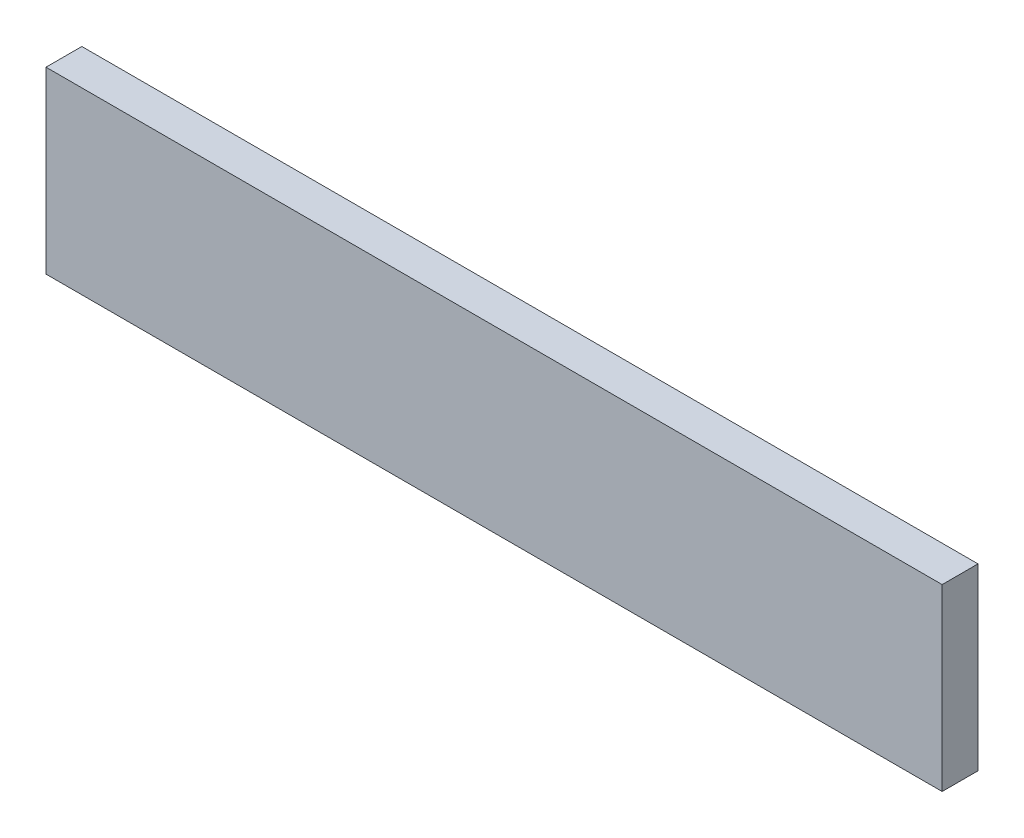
from build123d import *

# Parameters (mm, degrees)
SKETCH1_W           = 250
SKETCH1_H           = 50
BOSS_EXTRUDE1_DEPTH = 10


with BuildPart() as part:
    # Sketch1 → Boss-Extrude1 (new body)
    with BuildSketch(Plane.XY):
        with Locations((125, 25)):
            Rectangle(SKETCH1_W, SKETCH1_H)
    extrude(amount=BOSS_EXTRUDE1_DEPTH)


solid = part.part
